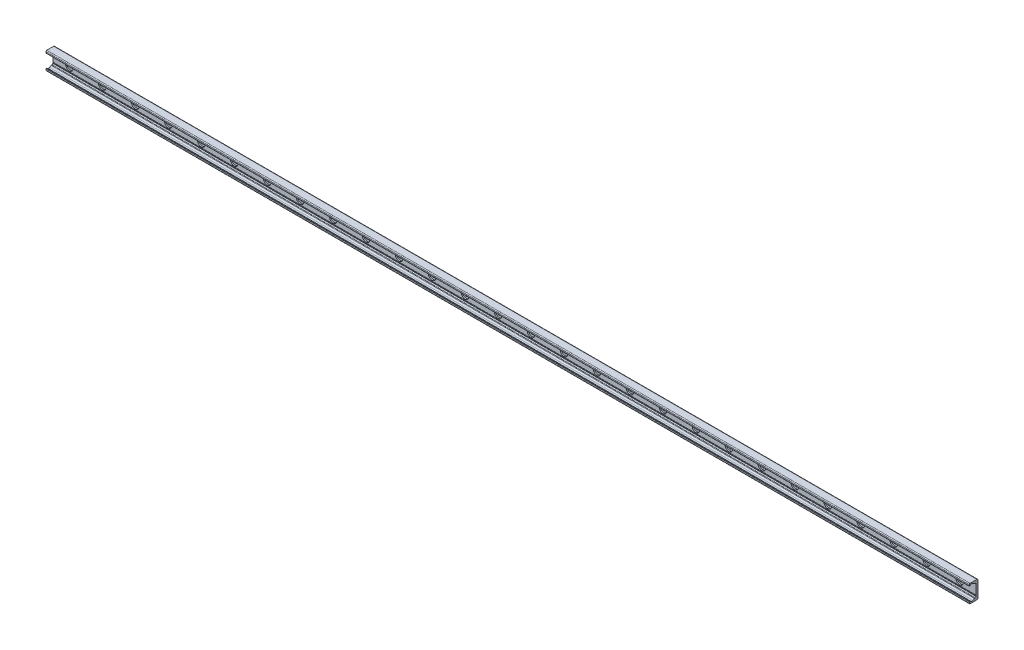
from build123d import *

# Parameters (mm, degrees)
BOSS_EXTRUDE1_DEPTH = 1120
SKETCH2_R           = 9
SKETCH2_R_2         = 4.5
CUT_EXTRUDE1_DEPTH  = 3.1
SKETCH2_2_R         = 4.5
CUT_EXTRUDE2_DEPTH  = 1121.3278538
LPATTERN1_COUNT     = 28
LPATTERN1_PITCH     = 80


with BuildPart() as part:
    # Sketch1 → Boss-Extrude1 (new, symmetric)
    with BuildSketch(Plane(origin=(0, 0, 0), x_dir=(0, 0, -1), z_dir=(1, 0, 0))):
        with BuildLine():
            Line((0, 0), (0, 19))
            ThreePointArc((0, 19), (-0.732233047, 20.767766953), (-2.5, 21.5))
            Line((-2.5, 21.5), (-19, 21.5))
            ThreePointArc((-19, 21.5), (-20.414213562, 20.914213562), (-21, 19.5))
            Line((-21, 19.5), (-21, 16.625057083))
            ThreePointArc((-21, 16.625057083), (-20.553251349, 15.888838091), (-19.693931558, 15.945160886))
            Line((-19.693931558, 15.945160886), (-16.794305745, 17.975500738))
            ThreePointArc((-16.794305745, 17.975500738), (-14.5, 18.69889256), (-12.205694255, 17.975500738))
            Line((-12.205694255, 17.975500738), (-8.829831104, 15.611695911))
            ThreePointArc((-8.829831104, 15.611695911), (-8.28408983, 15.342566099), (-7.682678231, 15.25))
            Line((-7.682678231, 15.25), (-6.5, 15.25))
            ThreePointArc((-6.5, 15.25), (-5.085786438, 14.664213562), (-4.5, 13.25))
            Line((-4.5, 13.25), (-4.5, -10.75))
            ThreePointArc((-4.5, -10.75), (-4.25, -11), (-4.5, -11.25))
            Line((-4.5, -11.25), (-4.5, -12.25))
            ThreePointArc((-4.5, -12.25), (-4.25, -12.5), (-4.5, -12.75))
            Line((-4.5, -12.75), (-4.5, -13.25))
            ThreePointArc((-4.5, -13.25), (-5.085786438, -14.664213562), (-6.5, -15.25))
            Line((-6.5, -15.25), (-7.682678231, -15.25))
            ThreePointArc((-7.682678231, -15.25), (-8.28408983, -15.342566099), (-8.829831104, -15.611695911))
            Line((-8.829831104, -15.611695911), (-12.205694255, -17.975500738))
            ThreePointArc((-12.205694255, -17.975500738), (-14.5, -18.69889256), (-16.794305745, -17.975500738))
            Line((-16.794305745, -17.975500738), (-19.693931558, -15.945160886))
            ThreePointArc((-19.693931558, -15.945160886), (-20.553251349, -15.888838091), (-21, -16.625057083))
            Line((-21, -16.625057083), (-21, -19.5))
            ThreePointArc((-21, -19.5), (-20.414213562, -20.914213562), (-19, -21.5))
            Line((-19, -21.5), (-2.5, -21.5))
            ThreePointArc((-2.5, -21.5), (-0.732233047, -20.767766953), (0, -19))
            Line((0, -19), (0, 0))
        make_face()
    extrude(amount=BOSS_EXTRUDE1_DEPTH, both=True)

    # Sketch2 → Cut-Extrude1 (cut)
    with BuildSketch(Plane.XY.offset(4.5)):
        with Locations((1080, 0)):
            Circle(SKETCH2_R)
        with Locations((1080, 0)):
            Circle(SKETCH2_R_2, mode=Mode.SUBTRACT)
    cut_extrude1 = extrude(amount=-CUT_EXTRUDE1_DEPTH, mode=Mode.SUBTRACT)

    # Sketch2_2 → Cut-Extrude2 (cut, through all)
    with BuildSketch(Plane.XY.offset(4.5)):
        with Locations((1080, 0)):
            Circle(SKETCH2_2_R)
    cut_extrude2 = extrude(amount=-CUT_EXTRUDE2_DEPTH, mode=Mode.SUBTRACT)

    # LPattern1: Cut-Extrude1, Cut-Extrude2 ×28
    with Locations(*[(-i * LPATTERN1_PITCH, 0, 0) for i in range(1, LPATTERN1_COUNT)]):
        add(cut_extrude1, mode=Mode.SUBTRACT)
        add(cut_extrude2, mode=Mode.SUBTRACT)


solid = part.part
